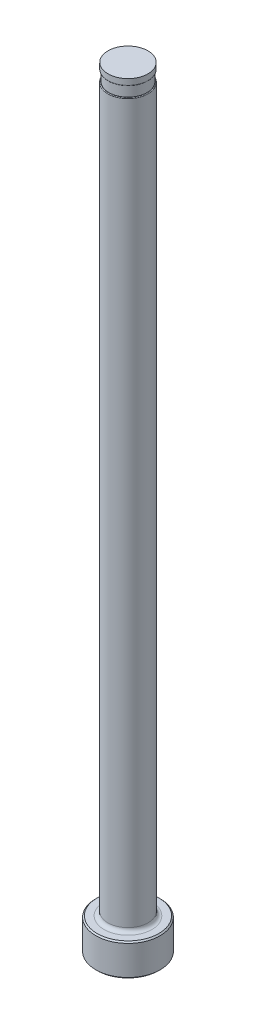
from build123d import *

# Parameters (mm, degrees)
CHAMFER1_SIZE     = 0.254
FILLET1_R         = 0.762
SKETCH2_W         = 0.2032
SKETCH2_H         = 2.032
D_SLOT_DEPTH      = 153.664354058
D_SLOT_DEPTH_BACK = 153.664354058
SKETCH5_W         = 0.01905
SKETCH5_H         = 1.27
FILLET2_R         = 0.127


with BuildPart() as part:
    # Sketch1 → Revolve1 (revolve)
    with BuildSketch(Plane.XY, mode=Mode.PRIVATE) as revolve1_sk:
        Polygon((0, 0), (-6.35, 0), (-6.35, 6.35), (-3.96875, 6.35), (-3.96875, 152.4), (0, 152.4), align=None)
    revolve(revolve1_sk.sketch.rotate(Axis((0, 259.958771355, 0), (0, -1, 0)), 270), axis=Axis((0, 259.958771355, 0), (0, -1, 0)))

    # Chamfer1
    chamfer1_edges = [part.edges().sort_by_distance(p)[0] for p in [
        (0, 6.35, -6.35),
        (0, 0, -6.35),
    ]]
    chamfer(chamfer1_edges, length=CHAMFER1_SIZE)

    # Fillet1
    fillet1_edges = [part.edges().sort_by_distance(p)[0] for p in [
        (0, 6.35, -3.96875),
    ]]
    fillet(fillet1_edges, radius=FILLET1_R)

    # Sketch2 → Vent Relief (revolve, cut)
    with BuildSketch(Plane.XY, mode=Mode.PRIVATE) as vent_relief_sk:
        with Locations((-3.86715, 150.114)):
            Rectangle(SKETCH2_W, SKETCH2_H)
    revolve(vent_relief_sk.sketch.rotate(Axis((0, 153.448281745, 0), (0, -1, 0)), 270), axis=Axis((0, 153.448281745, 0), (0, -1, 0)), mode=Mode.SUBTRACT)

    # Sketch3 → D-Slot (cut, two sides: drawn at the far end of the back side and taken through both)
    with BuildSketch(Plane.XY.offset(-D_SLOT_DEPTH_BACK)):
        with BuildLine():
            Line((-3.76555, 150.114), (-3.76555, 86.614))
            ThreePointArc((-3.76555, 86.614), (-3.816763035, 86.046038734), (-3.96875, 85.4964))
            Line((-3.96875, 85.4964), (-3.96875, 150.114))
            Line((-3.96875, 150.114), (-3.76555, 150.114))
        make_face()
    extrude(amount=D_SLOT_DEPTH + D_SLOT_DEPTH_BACK, mode=Mode.SUBTRACT)

    # Sketch5 → Vent Diameter (revolve, cut)
    with BuildSketch(Plane.XY, mode=Mode.PRIVATE) as vent_diameter_sk:
        with Locations((-3.959225, 151.765)):
            Rectangle(SKETCH5_W, SKETCH5_H)
    revolve(vent_diameter_sk.sketch.rotate(Axis((0, 152.687735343, 0), (0, -1, 0)), 90), axis=Axis((0, 152.687735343, 0), (0, -1, 0)), mode=Mode.SUBTRACT)

    # Fillet2
    fillet2_edges = [part.edges().sort_by_distance(p)[0] for p in [
        (3.219188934, 149.098, -2.321163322),
        (0, 151.13, 3.9497),
    ]]
    fillet(fillet2_edges, radius=FILLET2_R)


solid = part.part
